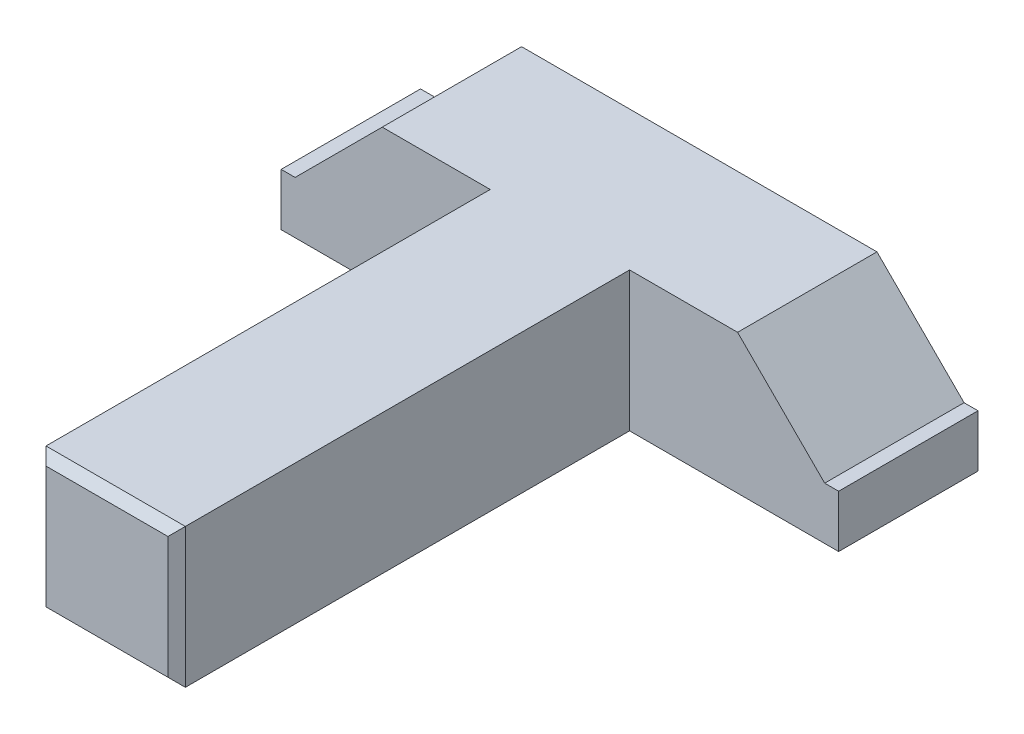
ISO-10303-21;
HEADER;
FILE_DESCRIPTION(('STEP AP214'),'2;1');
FILE_NAME('part.step','',(''),(''),'','','');
FILE_SCHEMA(('AUTOMOTIVE_DESIGN { 1 0 10303 214 1 1 1 1 }'));
ENDSEC;
DATA;
#1=APPLICATION_CONTEXT('core data for automotive mechanical design processes');
#2=APPLICATION_PROTOCOL_DEFINITION('international standard','automotive_design',2000,#1);
#3=PRODUCT_CONTEXT('',#1,'mechanical');
#4=PRODUCT('Part','Part','',(#3));
#5=PRODUCT_RELATED_PRODUCT_CATEGORY('part','',(#4));
#6=PRODUCT_DEFINITION_FORMATION('','',#4);
#7=PRODUCT_DEFINITION_CONTEXT('part definition',#1,'design');
#8=PRODUCT_DEFINITION('design','',#6,#7);
#9=PRODUCT_DEFINITION_SHAPE('','',#8);
#10=(LENGTH_UNIT() NAMED_UNIT(*) SI_UNIT(.MILLI.,.METRE.));
#11=(NAMED_UNIT(*) PLANE_ANGLE_UNIT() SI_UNIT($,.RADIAN.));
#12=(NAMED_UNIT(*) SI_UNIT($,.STERADIAN.) SOLID_ANGLE_UNIT());
#13=UNCERTAINTY_MEASURE_WITH_UNIT(LENGTH_MEASURE(1.E-05),#10,'distance_accuracy_value','');
#14=(GEOMETRIC_REPRESENTATION_CONTEXT(3) GLOBAL_UNCERTAINTY_ASSIGNED_CONTEXT((#13)) GLOBAL_UNIT_ASSIGNED_CONTEXT((#10,
#11,#12)) REPRESENTATION_CONTEXT('',''));
#15=CARTESIAN_POINT('',(0.,0.,0.));
#16=DIRECTION('',(0.,0.,1.));
#17=DIRECTION('',(1.,0.,0.));
#18=AXIS2_PLACEMENT_3D('',#15,#16,#17);
#19=CARTESIAN_POINT('',(-37.8071162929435,56.8194270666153,337.5));
#20=DIRECTION('',(0.,0.707106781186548,0.707106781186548));
#21=DIRECTION('',(0.,-0.707106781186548,0.707106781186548));
#22=AXIS2_PLACEMENT_3D('',#19,#20,#21);
#23=PLANE('',#22);
#24=DIRECTION('',(1.,0.,0.));
#25=VECTOR('',#24,1.);
#26=CARTESIAN_POINT('',(-88.8071162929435,59.3194270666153,335.));
#27=LINE('',#26,#25);
#28=CARTESIAN_POINT('',(-26.8071162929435,59.3194270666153,335.));
#29=VERTEX_POINT('',#28);
#30=CARTESIAN_POINT('',(53.1928837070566,59.3194270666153,335.));
#31=VERTEX_POINT('',#30);
#32=EDGE_CURVE('E138',#29,#31,#27,.T.);
#33=ORIENTED_EDGE('',*,*,#32,.F.);
#34=DIRECTION('',(-0.577350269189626,0.577350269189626,-0.577350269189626));
#35=VECTOR('',#34,1.);
#36=CARTESIAN_POINT('',(-21.8071162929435,54.3194270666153,340.));
#37=LINE('',#36,#35);
#38=CARTESIAN_POINT('',(-21.8071162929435,54.3194270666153,340.));
#39=VERTEX_POINT('',#38);
#40=EDGE_CURVE('E136',#39,#29,#37,.T.);
#41=ORIENTED_EDGE('',*,*,#40,.F.);
#42=DIRECTION('',(1.,0.,0.));
#43=VECTOR('',#42,1.);
#44=CARTESIAN_POINT('',(13.1928837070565,54.3194270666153,340.));
#45=LINE('',#44,#43);
#46=CARTESIAN_POINT('',(48.1928837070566,54.3194270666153,340.));
#47=VERTEX_POINT('',#46);
#48=EDGE_CURVE('E125',#47,#39,#45,.F.);
#49=ORIENTED_EDGE('',*,*,#48,.F.);
#50=DIRECTION('',(-0.577350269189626,-0.577350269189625,0.577350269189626));
#51=VECTOR('',#50,1.);
#52=CARTESIAN_POINT('',(53.1928837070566,59.3194270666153,335.));
#53=LINE('',#52,#51);
#54=EDGE_CURVE('E154',#31,#47,#53,.T.);
#55=ORIENTED_EDGE('',*,*,#54,.F.);
#56=EDGE_LOOP('',(#33,#41,#49,#55));
#57=FACE_BOUND('',#56,.T.);
#58=ADVANCED_FACE('F16',(#57),#23,.T.);
#59=CARTESIAN_POINT('',(13.1928837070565,19.3194270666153,340.));
#60=DIRECTION('',(0.,0.,1.));
#61=DIRECTION('',(1.,0.,0.));
#62=AXIS2_PLACEMENT_3D('',#59,#60,#61);
#63=PLANE('',#62);
#64=DIRECTION('',(0.,1.,0.));
#65=VECTOR('',#64,1.);
#66=CARTESIAN_POINT('',(-21.8071162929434,-0.680572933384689,340.));
#67=LINE('',#66,#65);
#68=CARTESIAN_POINT('',(-21.8071162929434,-15.6805729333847,340.));
#69=VERTEX_POINT('',#68);
#70=EDGE_CURVE('E129',#69,#39,#67,.T.);
#71=ORIENTED_EDGE('',*,*,#70,.F.);
#72=DIRECTION('',(1.,0.,0.));
#73=VECTOR('',#72,1.);
#74=CARTESIAN_POINT('',(93.1928837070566,-15.6805729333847,340.));
#75=LINE('',#74,#73);
#76=CARTESIAN_POINT('',(48.1928837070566,-15.6805729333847,340.));
#77=VERTEX_POINT('',#76);
#78=EDGE_CURVE('E159',#77,#69,#75,.F.);
#79=ORIENTED_EDGE('',*,*,#78,.F.);
#80=DIRECTION('',(0.,1.,0.));
#81=VECTOR('',#80,1.);
#82=CARTESIAN_POINT('',(48.1928837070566,39.3194270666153,340.));
#83=LINE('',#82,#81);
#84=EDGE_CURVE('E131',#47,#77,#83,.F.);
#85=ORIENTED_EDGE('',*,*,#84,.F.);
#86=ORIENTED_EDGE('',*,*,#48,.T.);
#87=EDGE_LOOP('',(#71,#79,#85,#86));
#88=FACE_BOUND('',#87,.T.);
#89=ADVANCED_FACE('F127',(#88),#63,.T.);
#90=CARTESIAN_POINT('',(-24.3071162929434,-0.680572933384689,337.5));
#91=DIRECTION('',(-0.707106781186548,0.,0.707106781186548));
#92=DIRECTION('',(0.707106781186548,0.,0.707106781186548));
#93=AXIS2_PLACEMENT_3D('',#90,#91,#92);
#94=PLANE('',#93);
#95=DIRECTION('',(0.,1.,0.));
#96=VECTOR('',#95,1.);
#97=CARTESIAN_POINT('',(-26.8071162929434,-20.6805729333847,335.));
#98=LINE('',#97,#96);
#99=CARTESIAN_POINT('',(-26.8071162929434,-20.6805729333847,335.));
#100=VERTEX_POINT('',#99);
#101=EDGE_CURVE('E165',#100,#29,#98,.T.);
#102=ORIENTED_EDGE('',*,*,#101,.F.);
#103=DIRECTION('',(-0.577350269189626,-0.577350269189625,-0.577350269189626));
#104=VECTOR('',#103,1.);
#105=CARTESIAN_POINT('',(-21.8071162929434,-15.6805729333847,340.));
#106=LINE('',#105,#104);
#107=EDGE_CURVE('E145',#69,#100,#106,.T.);
#108=ORIENTED_EDGE('',*,*,#107,.F.);
#109=ORIENTED_EDGE('',*,*,#70,.T.);
#110=ORIENTED_EDGE('',*,*,#40,.T.);
#111=EDGE_LOOP('',(#102,#108,#109,#110));
#112=FACE_BOUND('',#111,.T.);
#113=ADVANCED_FACE('F143',(#112),#94,.T.);
#114=CARTESIAN_POINT('',(-138.807116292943,9.31942706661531,0.));
#115=DIRECTION('',(-0.707106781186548,0.707106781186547,0.));
#116=DIRECTION('',(-0.707106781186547,-0.707106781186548,0.));
#117=AXIS2_PLACEMENT_3D('',#114,#115,#116);
#118=PLANE('',#117);
#119=DIRECTION('',(-0.707106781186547,-0.707106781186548,0.));
#120=VECTOR('',#119,1.);
#121=CARTESIAN_POINT('',(-88.8071162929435,59.3194270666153,0.));
#122=LINE('',#121,#120);
#123=CARTESIAN_POINT('',(-88.8071162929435,59.3194270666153,0.));
#124=VERTEX_POINT('',#123);
#125=CARTESIAN_POINT('',(-138.807116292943,9.3194270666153,0.));
#126=VERTEX_POINT('',#125);
#127=EDGE_CURVE('E195',#124,#126,#122,.T.);
#128=ORIENTED_EDGE('',*,*,#127,.T.);
#129=DIRECTION('',(0.,0.,1.));
#130=VECTOR('',#129,1.);
#131=CARTESIAN_POINT('',(-138.807116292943,9.3194270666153,0.));
#132=LINE('',#131,#130);
#133=CARTESIAN_POINT('',(-138.807116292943,9.3194270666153,80.));
#134=VERTEX_POINT('',#133);
#135=EDGE_CURVE('E141',#134,#126,#132,.F.);
#136=ORIENTED_EDGE('',*,*,#135,.F.);
#137=DIRECTION('',(-0.707106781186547,-0.707106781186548,0.));
#138=VECTOR('',#137,1.);
#139=CARTESIAN_POINT('',(-88.8071162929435,59.3194270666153,80.));
#140=LINE('',#139,#138);
#141=CARTESIAN_POINT('',(-88.8071162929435,59.3194270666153,80.));
#142=VERTEX_POINT('',#141);
#143=EDGE_CURVE('E176',#142,#134,#140,.T.);
#144=ORIENTED_EDGE('',*,*,#143,.F.);
#145=DIRECTION('',(0.,0.,1.));
#146=VECTOR('',#145,1.);
#147=CARTESIAN_POINT('',(-88.8071162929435,59.3194270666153,0.));
#148=LINE('',#147,#146);
#149=EDGE_CURVE('E157',#124,#142,#148,.T.);
#150=ORIENTED_EDGE('',*,*,#149,.F.);
#151=EDGE_LOOP('',(#128,#136,#144,#150));
#152=FACE_BOUND('',#151,.T.);
#153=ADVANCED_FACE('F278',(#152),#118,.T.);
#154=CARTESIAN_POINT('',(-146.807116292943,9.3194270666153,0.));
#155=DIRECTION('',(0.,1.,0.));
#156=DIRECTION('',(0.,0.,1.));
#157=AXIS2_PLACEMENT_3D('',#154,#155,#156);
#158=PLANE('',#157);
#159=DIRECTION('',(1.,0.,0.));
#160=VECTOR('',#159,1.);
#161=CARTESIAN_POINT('',(13.1928837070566,9.31942706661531,0.));
#162=LINE('',#161,#160);
#163=CARTESIAN_POINT('',(-146.807116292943,9.3194270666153,0.));
#164=VERTEX_POINT('',#163);
#165=EDGE_CURVE('E193',#126,#164,#162,.F.);
#166=ORIENTED_EDGE('',*,*,#165,.T.);
#167=DIRECTION('',(0.,0.,1.));
#168=VECTOR('',#167,1.);
#169=CARTESIAN_POINT('',(-146.807116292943,9.3194270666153,0.));
#170=LINE('',#169,#168);
#171=CARTESIAN_POINT('',(-146.807116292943,9.3194270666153,80.));
#172=VERTEX_POINT('',#171);
#173=EDGE_CURVE('E184',#172,#164,#170,.F.);
#174=ORIENTED_EDGE('',*,*,#173,.F.);
#175=DIRECTION('',(1.,0.,0.));
#176=VECTOR('',#175,1.);
#177=CARTESIAN_POINT('',(13.1928837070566,9.31942706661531,80.));
#178=LINE('',#177,#176);
#179=EDGE_CURVE('E173',#134,#172,#178,.F.);
#180=ORIENTED_EDGE('',*,*,#179,.F.);
#181=ORIENTED_EDGE('',*,*,#135,.T.);
#182=EDGE_LOOP('',(#166,#174,#180,#181));
#183=FACE_BOUND('',#182,.T.);
#184=ADVANCED_FACE('F282',(#183),#158,.T.);
#185=CARTESIAN_POINT('',(165.192883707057,9.31942706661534,0.));
#186=DIRECTION('',(0.,1.,0.));
#187=DIRECTION('',(0.,0.,1.));
#188=AXIS2_PLACEMENT_3D('',#185,#186,#187);
#189=PLANE('',#188);
#190=DIRECTION('',(1.,0.,0.));
#191=VECTOR('',#190,1.);
#192=CARTESIAN_POINT('',(13.1928837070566,9.31942706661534,0.));
#193=LINE('',#192,#191);
#194=CARTESIAN_POINT('',(173.192883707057,9.31942706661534,0.));
#195=VERTEX_POINT('',#194);
#196=CARTESIAN_POINT('',(165.192883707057,9.31942706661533,0.));
#197=VERTEX_POINT('',#196);
#198=EDGE_CURVE('E187',#195,#197,#193,.F.);
#199=ORIENTED_EDGE('',*,*,#198,.T.);
#200=DIRECTION('',(0.,0.,1.));
#201=VECTOR('',#200,1.);
#202=CARTESIAN_POINT('',(165.192883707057,9.31942706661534,0.));
#203=LINE('',#202,#201);
#204=CARTESIAN_POINT('',(165.192883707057,9.31942706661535,80.));
#205=VERTEX_POINT('',#204);
#206=EDGE_CURVE('E151',#205,#197,#203,.F.);
#207=ORIENTED_EDGE('',*,*,#206,.F.);
#208=DIRECTION('',(1.,0.,0.));
#209=VECTOR('',#208,1.);
#210=CARTESIAN_POINT('',(13.1928837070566,9.31942706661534,80.));
#211=LINE('',#210,#209);
#212=CARTESIAN_POINT('',(173.192883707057,9.31942706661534,80.));
#213=VERTEX_POINT('',#212);
#214=EDGE_CURVE('E212',#213,#205,#211,.F.);
#215=ORIENTED_EDGE('',*,*,#214,.F.);
#216=DIRECTION('',(0.,0.,-1.));
#217=VECTOR('',#216,1.);
#218=CARTESIAN_POINT('',(173.192883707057,9.31942706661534,0.));
#219=LINE('',#218,#217);
#220=EDGE_CURVE('E203',#195,#213,#219,.F.);
#221=ORIENTED_EDGE('',*,*,#220,.F.);
#222=EDGE_LOOP('',(#199,#207,#215,#221));
#223=FACE_BOUND('',#222,.T.);
#224=ADVANCED_FACE('F272',(#223),#189,.T.);
#225=CARTESIAN_POINT('',(115.192883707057,59.3194270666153,0.));
#226=DIRECTION('',(0.707106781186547,0.707106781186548,0.));
#227=DIRECTION('',(-0.707106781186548,0.707106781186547,0.));
#228=AXIS2_PLACEMENT_3D('',#225,#226,#227);
#229=PLANE('',#228);
#230=DIRECTION('',(-0.707106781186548,0.707106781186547,0.));
#231=VECTOR('',#230,1.);
#232=CARTESIAN_POINT('',(165.192883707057,9.31942706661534,0.));
#233=LINE('',#232,#231);
#234=CARTESIAN_POINT('',(115.192883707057,59.3194270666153,0.));
#235=VERTEX_POINT('',#234);
#236=EDGE_CURVE('E200',#197,#235,#233,.T.);
#237=ORIENTED_EDGE('',*,*,#236,.T.);
#238=DIRECTION('',(0.,0.,1.));
#239=VECTOR('',#238,1.);
#240=CARTESIAN_POINT('',(115.192883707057,59.3194270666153,0.));
#241=LINE('',#240,#239);
#242=CARTESIAN_POINT('',(115.192883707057,59.3194270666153,80.));
#243=VERTEX_POINT('',#242);
#244=EDGE_CURVE('E160',#243,#235,#241,.F.);
#245=ORIENTED_EDGE('',*,*,#244,.F.);
#246=DIRECTION('',(-0.707106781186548,0.707106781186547,0.));
#247=VECTOR('',#246,1.);
#248=CARTESIAN_POINT('',(165.192883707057,9.31942706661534,80.));
#249=LINE('',#248,#247);
#250=EDGE_CURVE('E210',#205,#243,#249,.T.);
#251=ORIENTED_EDGE('',*,*,#250,.F.);
#252=ORIENTED_EDGE('',*,*,#206,.T.);
#253=EDGE_LOOP('',(#237,#245,#251,#252));
#254=FACE_BOUND('',#253,.T.);
#255=ADVANCED_FACE('F274',(#254),#229,.T.);
#256=CARTESIAN_POINT('',(50.6928837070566,39.3194270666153,337.5));
#257=DIRECTION('',(0.707106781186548,0.,0.707106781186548));
#258=DIRECTION('',(0.707106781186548,0.,-0.707106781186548));
#259=AXIS2_PLACEMENT_3D('',#256,#257,#258);
#260=PLANE('',#259);
#261=DIRECTION('',(0.,1.,0.));
#262=VECTOR('',#261,1.);
#263=CARTESIAN_POINT('',(53.1928837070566,59.3194270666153,335.));
#264=LINE('',#263,#262);
#265=CARTESIAN_POINT('',(53.1928837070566,-20.6805729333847,335.));
#266=VERTEX_POINT('',#265);
#267=EDGE_CURVE('E209',#31,#266,#264,.F.);
#268=ORIENTED_EDGE('',*,*,#267,.F.);
#269=ORIENTED_EDGE('',*,*,#54,.T.);
#270=ORIENTED_EDGE('',*,*,#84,.T.);
#271=DIRECTION('',(-0.577350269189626,0.577350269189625,0.577350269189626));
#272=VECTOR('',#271,1.);
#273=CARTESIAN_POINT('',(53.1928837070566,-20.6805729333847,335.));
#274=LINE('',#273,#272);
#275=EDGE_CURVE('E61',#266,#77,#274,.T.);
#276=ORIENTED_EDGE('',*,*,#275,.F.);
#277=EDGE_LOOP('',(#268,#269,#270,#276));
#278=FACE_BOUND('',#277,.T.);
#279=ADVANCED_FACE('F245',(#278),#260,.T.);
#280=CARTESIAN_POINT('',(-88.8071162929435,59.3194270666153,0.));
#281=DIRECTION('',(0.,1.,0.));
#282=DIRECTION('',(0.,0.,1.));
#283=AXIS2_PLACEMENT_3D('',#280,#281,#282);
#284=PLANE('',#283);
#285=DIRECTION('',(1.,0.,0.));
#286=VECTOR('',#285,1.);
#287=CARTESIAN_POINT('',(13.1928837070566,59.3194270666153,80.));
#288=LINE('',#287,#286);
#289=CARTESIAN_POINT('',(-26.8071162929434,59.3194270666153,80.));
#290=VERTEX_POINT('',#289);
#291=EDGE_CURVE('E179',#290,#142,#288,.F.);
#292=ORIENTED_EDGE('',*,*,#291,.F.);
#293=DIRECTION('',(0.,0.,1.));
#294=VECTOR('',#293,1.);
#295=CARTESIAN_POINT('',(-26.8071162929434,59.3194270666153,80.));
#296=LINE('',#295,#294);
#297=EDGE_CURVE('E168',#29,#290,#296,.F.);
#298=ORIENTED_EDGE('',*,*,#297,.F.);
#299=ORIENTED_EDGE('',*,*,#32,.T.);
#300=DIRECTION('',(0.,0.,-1.));
#301=VECTOR('',#300,1.);
#302=CARTESIAN_POINT('',(53.1928837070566,59.3194270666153,80.));
#303=LINE('',#302,#301);
#304=CARTESIAN_POINT('',(53.1928837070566,59.3194270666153,80.));
#305=VERTEX_POINT('',#304);
#306=EDGE_CURVE('E217',#305,#31,#303,.F.);
#307=ORIENTED_EDGE('',*,*,#306,.F.);
#308=DIRECTION('',(1.,0.,0.));
#309=VECTOR('',#308,1.);
#310=CARTESIAN_POINT('',(13.1928837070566,59.3194270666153,80.));
#311=LINE('',#310,#309);
#312=EDGE_CURVE('E66',#243,#305,#311,.F.);
#313=ORIENTED_EDGE('',*,*,#312,.F.);
#314=ORIENTED_EDGE('',*,*,#244,.T.);
#315=DIRECTION('',(1.,0.,0.));
#316=VECTOR('',#315,1.);
#317=CARTESIAN_POINT('',(13.1928837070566,59.3194270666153,0.));
#318=LINE('',#317,#316);
#319=EDGE_CURVE('E197',#235,#124,#318,.F.);
#320=ORIENTED_EDGE('',*,*,#319,.T.);
#321=ORIENTED_EDGE('',*,*,#149,.T.);
#322=EDGE_LOOP('',(#292,#298,#299,#307,#313,#314,#320,#321));
#323=FACE_BOUND('',#322,.T.);
#324=ADVANCED_FACE('F248',(#323),#284,.T.);
#325=CARTESIAN_POINT('',(93.1928837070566,-18.1805729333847,337.5));
#326=DIRECTION('',(0.,-0.707106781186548,0.707106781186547));
#327=DIRECTION('',(0.,-0.707106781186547,-0.707106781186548));
#328=AXIS2_PLACEMENT_3D('',#325,#326,#327);
#329=PLANE('',#328);
#330=DIRECTION('',(1.,0.,0.));
#331=VECTOR('',#330,1.);
#332=CARTESIAN_POINT('',(173.192883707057,-20.6805729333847,335.));
#333=LINE('',#332,#331);
#334=EDGE_CURVE('E20',#266,#100,#333,.F.);
#335=ORIENTED_EDGE('',*,*,#334,.F.);
#336=ORIENTED_EDGE('',*,*,#275,.T.);
#337=ORIENTED_EDGE('',*,*,#78,.T.);
#338=ORIENTED_EDGE('',*,*,#107,.T.);
#339=EDGE_LOOP('',(#335,#336,#337,#338));
#340=FACE_BOUND('',#339,.T.);
#341=ADVANCED_FACE('F242',(#340),#329,.T.);
#342=CARTESIAN_POINT('',(-26.8071162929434,-20.6805729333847,80.));
#343=DIRECTION('',(-1.,0.,0.));
#344=DIRECTION('',(0.,0.,1.));
#345=AXIS2_PLACEMENT_3D('',#342,#343,#344);
#346=PLANE('',#345);
#347=DIRECTION('',(0.,1.,0.));
#348=VECTOR('',#347,1.);
#349=CARTESIAN_POINT('',(-26.8071162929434,13.6833880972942,80.));
#350=LINE('',#349,#348);
#351=CARTESIAN_POINT('',(-26.8071162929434,-20.6805729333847,80.));
#352=VERTEX_POINT('',#351);
#353=EDGE_CURVE('E170',#352,#290,#350,.T.);
#354=ORIENTED_EDGE('',*,*,#353,.F.);
#355=DIRECTION('',(0.,0.,-1.));
#356=VECTOR('',#355,1.);
#357=CARTESIAN_POINT('',(-26.8071162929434,-20.6805729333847,0.));
#358=LINE('',#357,#356);
#359=EDGE_CURVE('E236',#100,#352,#358,.T.);
#360=ORIENTED_EDGE('',*,*,#359,.F.);
#361=ORIENTED_EDGE('',*,*,#101,.T.);
#362=ORIENTED_EDGE('',*,*,#297,.T.);
#363=EDGE_LOOP('',(#354,#360,#361,#362));
#364=FACE_BOUND('',#363,.T.);
#365=ADVANCED_FACE('F250',(#364),#346,.T.);
#366=CARTESIAN_POINT('',(13.1928837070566,13.6833880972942,80.));
#367=DIRECTION('',(0.,0.,1.));
#368=DIRECTION('',(1.,0.,0.));
#369=AXIS2_PLACEMENT_3D('',#366,#367,#368);
#370=PLANE('',#369);
#371=DIRECTION('',(0.,1.,0.));
#372=VECTOR('',#371,1.);
#373=CARTESIAN_POINT('',(-146.807116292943,-20.6805729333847,80.));
#374=LINE('',#373,#372);
#375=CARTESIAN_POINT('',(-146.807116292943,-20.6805729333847,80.));
#376=VERTEX_POINT('',#375);
#377=EDGE_CURVE('E175',#376,#172,#374,.T.);
#378=ORIENTED_EDGE('',*,*,#377,.F.);
#379=DIRECTION('',(1.,0.,0.));
#380=VECTOR('',#379,1.);
#381=CARTESIAN_POINT('',(173.192883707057,-20.6805729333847,80.));
#382=LINE('',#381,#380);
#383=EDGE_CURVE('E234',#352,#376,#382,.F.);
#384=ORIENTED_EDGE('',*,*,#383,.F.);
#385=ORIENTED_EDGE('',*,*,#353,.T.);
#386=ORIENTED_EDGE('',*,*,#291,.T.);
#387=ORIENTED_EDGE('',*,*,#143,.T.);
#388=ORIENTED_EDGE('',*,*,#179,.T.);
#389=EDGE_LOOP('',(#378,#384,#385,#386,#387,#388));
#390=FACE_BOUND('',#389,.T.);
#391=ADVANCED_FACE('F253',(#390),#370,.T.);
#392=CARTESIAN_POINT('',(-146.807116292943,-20.6805729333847,0.));
#393=DIRECTION('',(-1.,0.,0.));
#394=DIRECTION('',(0.,0.,1.));
#395=AXIS2_PLACEMENT_3D('',#392,#393,#394);
#396=PLANE('',#395);
#397=DIRECTION('',(0.,1.,0.));
#398=VECTOR('',#397,1.);
#399=CARTESIAN_POINT('',(-146.807116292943,13.6833880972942,0.));
#400=LINE('',#399,#398);
#401=CARTESIAN_POINT('',(-146.807116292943,-20.6805729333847,0.));
#402=VERTEX_POINT('',#401);
#403=EDGE_CURVE('E190',#164,#402,#400,.F.);
#404=ORIENTED_EDGE('',*,*,#403,.T.);
#405=DIRECTION('',(0.,0.,-1.));
#406=VECTOR('',#405,1.);
#407=CARTESIAN_POINT('',(-146.807116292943,-20.6805729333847,0.));
#408=LINE('',#407,#406);
#409=EDGE_CURVE('E231',#376,#402,#408,.T.);
#410=ORIENTED_EDGE('',*,*,#409,.F.);
#411=ORIENTED_EDGE('',*,*,#377,.T.);
#412=ORIENTED_EDGE('',*,*,#173,.T.);
#413=EDGE_LOOP('',(#404,#410,#411,#412));
#414=FACE_BOUND('',#413,.T.);
#415=ADVANCED_FACE('F257',(#414),#396,.T.);
#416=CARTESIAN_POINT('',(13.1928837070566,13.6833880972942,0.));
#417=DIRECTION('',(0.,0.,1.));
#418=DIRECTION('',(1.,0.,0.));
#419=AXIS2_PLACEMENT_3D('',#416,#417,#418);
#420=PLANE('',#419);
#421=ORIENTED_EDGE('',*,*,#403,.F.);
#422=ORIENTED_EDGE('',*,*,#165,.F.);
#423=ORIENTED_EDGE('',*,*,#127,.F.);
#424=ORIENTED_EDGE('',*,*,#319,.F.);
#425=ORIENTED_EDGE('',*,*,#236,.F.);
#426=ORIENTED_EDGE('',*,*,#198,.F.);
#427=DIRECTION('',(0.,1.,0.));
#428=VECTOR('',#427,1.);
#429=CARTESIAN_POINT('',(173.192883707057,9.31942706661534,0.));
#430=LINE('',#429,#428);
#431=CARTESIAN_POINT('',(173.192883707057,-20.6805729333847,0.));
#432=VERTEX_POINT('',#431);
#433=EDGE_CURVE('E192',#432,#195,#430,.T.);
#434=ORIENTED_EDGE('',*,*,#433,.F.);
#435=DIRECTION('',(1.,0.,0.));
#436=VECTOR('',#435,1.);
#437=CARTESIAN_POINT('',(173.192883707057,-20.6805729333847,0.));
#438=LINE('',#437,#436);
#439=EDGE_CURVE('E228',#402,#432,#438,.T.);
#440=ORIENTED_EDGE('',*,*,#439,.F.);
#441=EDGE_LOOP('',(#421,#422,#423,#424,#425,#426,#434,#440));
#442=FACE_BOUND('',#441,.T.);
#443=ADVANCED_FACE('F262',(#442),#420,.F.);
#444=CARTESIAN_POINT('',(173.192883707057,9.31942706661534,0.));
#445=DIRECTION('',(1.,0.,0.));
#446=DIRECTION('',(0.,0.,-1.));
#447=AXIS2_PLACEMENT_3D('',#444,#445,#446);
#448=PLANE('',#447);
#449=ORIENTED_EDGE('',*,*,#433,.T.);
#450=ORIENTED_EDGE('',*,*,#220,.T.);
#451=DIRECTION('',(0.,1.,0.));
#452=VECTOR('',#451,1.);
#453=CARTESIAN_POINT('',(173.192883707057,13.6833880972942,80.));
#454=LINE('',#453,#452);
#455=CARTESIAN_POINT('',(173.192883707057,-20.6805729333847,80.));
#456=VERTEX_POINT('',#455);
#457=EDGE_CURVE('E205',#456,#213,#454,.T.);
#458=ORIENTED_EDGE('',*,*,#457,.F.);
#459=DIRECTION('',(0.,0.,-1.));
#460=VECTOR('',#459,1.);
#461=CARTESIAN_POINT('',(173.192883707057,-20.6805729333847,0.));
#462=LINE('',#461,#460);
#463=EDGE_CURVE('E225',#432,#456,#462,.F.);
#464=ORIENTED_EDGE('',*,*,#463,.F.);
#465=EDGE_LOOP('',(#449,#450,#458,#464));
#466=FACE_BOUND('',#465,.T.);
#467=ADVANCED_FACE('F267',(#466),#448,.T.);
#468=CARTESIAN_POINT('',(13.1928837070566,13.6833880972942,80.));
#469=DIRECTION('',(0.,0.,1.));
#470=DIRECTION('',(1.,0.,0.));
#471=AXIS2_PLACEMENT_3D('',#468,#469,#470);
#472=PLANE('',#471);
#473=ORIENTED_EDGE('',*,*,#250,.T.);
#474=ORIENTED_EDGE('',*,*,#312,.T.);
#475=DIRECTION('',(0.,1.,0.));
#476=VECTOR('',#475,1.);
#477=CARTESIAN_POINT('',(53.1928837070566,59.3194270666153,80.));
#478=LINE('',#477,#476);
#479=CARTESIAN_POINT('',(53.1928837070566,-20.6805729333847,80.));
#480=VERTEX_POINT('',#479);
#481=EDGE_CURVE('E35',#480,#305,#478,.T.);
#482=ORIENTED_EDGE('',*,*,#481,.F.);
#483=DIRECTION('',(1.,0.,0.));
#484=VECTOR('',#483,1.);
#485=CARTESIAN_POINT('',(173.192883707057,-20.6805729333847,80.));
#486=LINE('',#485,#484);
#487=EDGE_CURVE('E26',#456,#480,#486,.F.);
#488=ORIENTED_EDGE('',*,*,#487,.F.);
#489=ORIENTED_EDGE('',*,*,#457,.T.);
#490=ORIENTED_EDGE('',*,*,#214,.T.);
#491=EDGE_LOOP('',(#473,#474,#482,#488,#489,#490));
#492=FACE_BOUND('',#491,.T.);
#493=ADVANCED_FACE('F268',(#492),#472,.T.);
#494=CARTESIAN_POINT('',(53.1928837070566,59.3194270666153,80.));
#495=DIRECTION('',(1.,0.,0.));
#496=DIRECTION('',(0.,0.,-1.));
#497=AXIS2_PLACEMENT_3D('',#494,#495,#496);
#498=PLANE('',#497);
#499=ORIENTED_EDGE('',*,*,#481,.T.);
#500=ORIENTED_EDGE('',*,*,#306,.T.);
#501=ORIENTED_EDGE('',*,*,#267,.T.);
#502=DIRECTION('',(0.,0.,-1.));
#503=VECTOR('',#502,1.);
#504=CARTESIAN_POINT('',(53.1928837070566,-20.6805729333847,0.));
#505=LINE('',#504,#503);
#506=EDGE_CURVE('E10',#480,#266,#505,.F.);
#507=ORIENTED_EDGE('',*,*,#506,.F.);
#508=EDGE_LOOP('',(#499,#500,#501,#507));
#509=FACE_BOUND('',#508,.T.);
#510=ADVANCED_FACE('F244',(#509),#498,.T.);
#511=CARTESIAN_POINT('',(173.192883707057,-20.6805729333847,0.));
#512=DIRECTION('',(0.,-1.,0.));
#513=DIRECTION('',(0.,0.,-1.));
#514=AXIS2_PLACEMENT_3D('',#511,#512,#513);
#515=PLANE('',#514);
#516=ORIENTED_EDGE('',*,*,#487,.T.);
#517=ORIENTED_EDGE('',*,*,#506,.T.);
#518=ORIENTED_EDGE('',*,*,#334,.T.);
#519=ORIENTED_EDGE('',*,*,#359,.T.);
#520=ORIENTED_EDGE('',*,*,#383,.T.);
#521=ORIENTED_EDGE('',*,*,#409,.T.);
#522=ORIENTED_EDGE('',*,*,#439,.T.);
#523=ORIENTED_EDGE('',*,*,#463,.T.);
#524=EDGE_LOOP('',(#516,#517,#518,#519,#520,#521,#522,#523));
#525=FACE_BOUND('',#524,.T.);
#526=ADVANCED_FACE('F18',(#525),#515,.T.);
#527=CLOSED_SHELL('',(#58,#89,#113,#153,#184,#224,#255,#279,#324,#341,#365,#391,#415,#443,#467,
#493,#510,#526));
#528=MANIFOLD_SOLID_BREP('B1',#527);
#529=ADVANCED_BREP_SHAPE_REPRESENTATION('',(#18,#528),#14);
#530=SHAPE_DEFINITION_REPRESENTATION(#9,#529);
ENDSEC;
END-ISO-10303-21;
